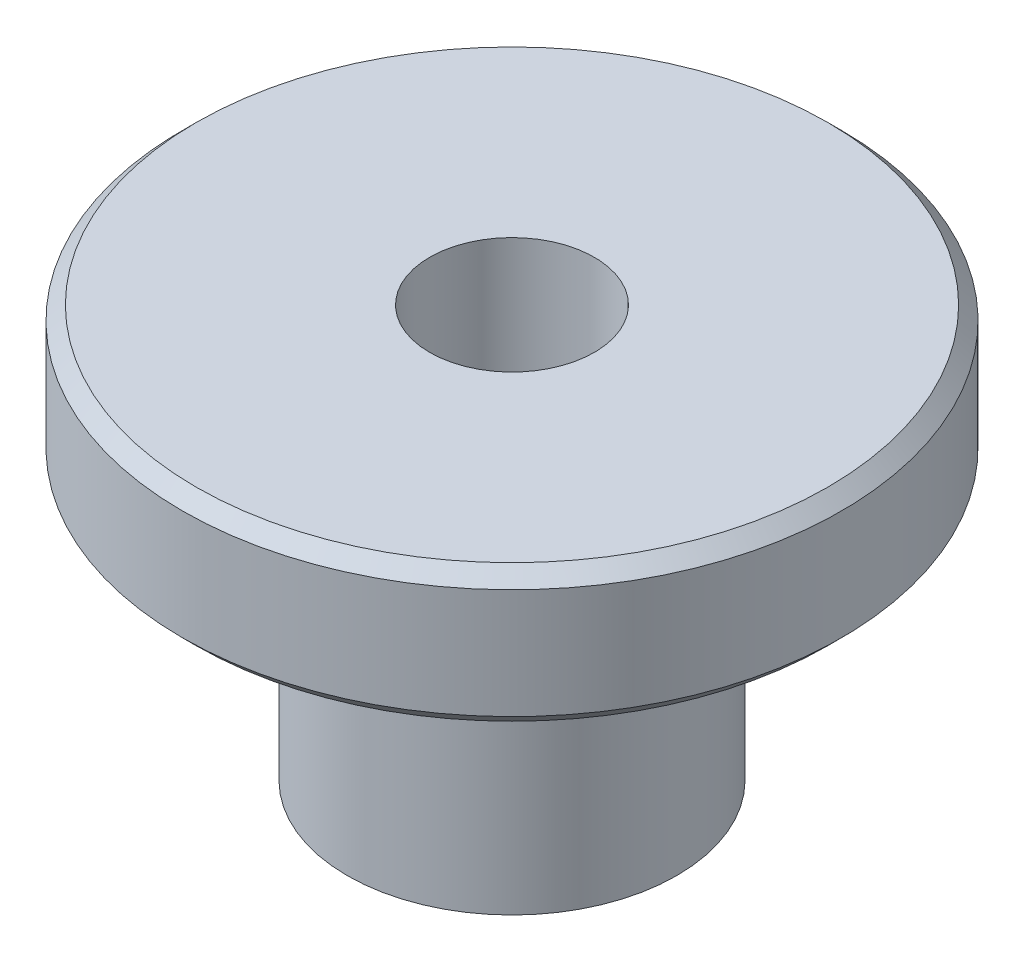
ISO-10303-21;
HEADER;
FILE_DESCRIPTION(('STEP AP214'),'2;1');
FILE_NAME('part.step','',(''),(''),'','','');
FILE_SCHEMA(('AUTOMOTIVE_DESIGN { 1 0 10303 214 1 1 1 1 }'));
ENDSEC;
DATA;
#1=APPLICATION_CONTEXT('core data for automotive mechanical design processes');
#2=APPLICATION_PROTOCOL_DEFINITION('international standard','automotive_design',2000,#1);
#3=PRODUCT_CONTEXT('',#1,'mechanical');
#4=PRODUCT('Part','Part','',(#3));
#5=PRODUCT_RELATED_PRODUCT_CATEGORY('part','',(#4));
#6=PRODUCT_DEFINITION_FORMATION('','',#4);
#7=PRODUCT_DEFINITION_CONTEXT('part definition',#1,'design');
#8=PRODUCT_DEFINITION('design','',#6,#7);
#9=PRODUCT_DEFINITION_SHAPE('','',#8);
#10=(LENGTH_UNIT() NAMED_UNIT(*) SI_UNIT(.MILLI.,.METRE.));
#11=(NAMED_UNIT(*) PLANE_ANGLE_UNIT() SI_UNIT($,.RADIAN.));
#12=(NAMED_UNIT(*) SI_UNIT($,.STERADIAN.) SOLID_ANGLE_UNIT());
#13=UNCERTAINTY_MEASURE_WITH_UNIT(LENGTH_MEASURE(1.E-05),#10,'distance_accuracy_value','');
#14=(GEOMETRIC_REPRESENTATION_CONTEXT(3) GLOBAL_UNCERTAINTY_ASSIGNED_CONTEXT((#13)) GLOBAL_UNIT_ASSIGNED_CONTEXT((#10,
#11,#12)) REPRESENTATION_CONTEXT('',''));
#15=CARTESIAN_POINT('',(0.,0.,0.));
#16=DIRECTION('',(0.,0.,1.));
#17=DIRECTION('',(1.,0.,0.));
#18=AXIS2_PLACEMENT_3D('',#15,#16,#17);
#19=CARTESIAN_POINT('',(5.99999999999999,9.99999999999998,0.));
#20=DIRECTION('',(0.,-1.,0.));
#21=DIRECTION('',(0.,0.,-1.));
#22=AXIS2_PLACEMENT_3D('',#19,#20,#21);
#23=PLANE('',#22);
#24=CARTESIAN_POINT('',(0.,10.,0.));
#25=DIRECTION('',(0.,-1.,0.));
#26=DIRECTION('',(0.,0.,-1.));
#27=AXIS2_PLACEMENT_3D('',#24,#25,#26);
#28=CIRCLE('',#27,6.);
#29=CARTESIAN_POINT('',(0.,10.,-6.));
#30=VERTEX_POINT('',#29);
#31=EDGE_CURVE('E38',#30,#30,#28,.T.);
#32=ORIENTED_EDGE('',*,*,#31,.F.);
#33=EDGE_LOOP('',(#32));
#34=FACE_BOUND('',#33,.T.);
#35=CARTESIAN_POINT('',(0.,10.,0.));
#36=DIRECTION('',(0.,1.,0.));
#37=DIRECTION('',(0.,0.,1.));
#38=AXIS2_PLACEMENT_3D('',#35,#36,#37);
#39=CIRCLE('',#38,11.5);
#40=CARTESIAN_POINT('',(0.,10.,11.5));
#41=VERTEX_POINT('',#40);
#42=EDGE_CURVE('E18',#41,#41,#39,.T.);
#43=ORIENTED_EDGE('',*,*,#42,.F.);
#44=EDGE_LOOP('',(#43));
#45=FACE_BOUND('',#44,.T.);
#46=ADVANCED_FACE('F15',(#34,#45),#23,.T.);
#47=CARTESIAN_POINT('',(0.,10.5,0.));
#48=DIRECTION('',(0.,1.,0.));
#49=DIRECTION('',(0.,0.,1.));
#50=AXIS2_PLACEMENT_3D('',#47,#48,#49);
#51=CONICAL_SURFACE('',#50,12.,0.785398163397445);
#52=CARTESIAN_POINT('',(0.,10.5,0.));
#53=DIRECTION('',(0.,-1.,0.));
#54=DIRECTION('',(0.,0.,-1.));
#55=AXIS2_PLACEMENT_3D('',#52,#53,#54);
#56=CIRCLE('',#55,12.);
#57=CARTESIAN_POINT('',(0.,10.5,-12.));
#58=VERTEX_POINT('',#57);
#59=EDGE_CURVE('E30',#58,#58,#56,.F.);
#60=ORIENTED_EDGE('',*,*,#59,.F.);
#61=EDGE_LOOP('',(#60));
#62=FACE_BOUND('',#61,.T.);
#63=ORIENTED_EDGE('',*,*,#42,.T.);
#64=EDGE_LOOP('',(#63));
#65=FACE_BOUND('',#64,.T.);
#66=ADVANCED_FACE('F46',(#62,#65),#51,.T.);
#67=CARTESIAN_POINT('',(0.,0.,0.));
#68=DIRECTION('',(0.,-1.,0.));
#69=DIRECTION('',(0.,0.,-1.));
#70=AXIS2_PLACEMENT_3D('',#67,#68,#69);
#71=CYLINDRICAL_SURFACE('',#70,6.);
#72=ORIENTED_EDGE('',*,*,#31,.T.);
#73=EDGE_LOOP('',(#72));
#74=FACE_BOUND('',#73,.T.);
#75=CARTESIAN_POINT('',(0.,0.,0.));
#76=DIRECTION('',(0.,-1.,0.));
#77=DIRECTION('',(0.,0.,-1.));
#78=AXIS2_PLACEMENT_3D('',#75,#76,#77);
#79=CIRCLE('',#78,6.);
#80=CARTESIAN_POINT('',(0.,0.,-6.));
#81=VERTEX_POINT('',#80);
#82=EDGE_CURVE('E36',#81,#81,#79,.T.);
#83=ORIENTED_EDGE('',*,*,#82,.F.);
#84=EDGE_LOOP('',(#83));
#85=FACE_BOUND('',#84,.T.);
#86=ADVANCED_FACE('F54',(#74,#85),#71,.T.);
#87=CARTESIAN_POINT('',(0.,0.,0.));
#88=DIRECTION('',(0.,-1.,0.));
#89=DIRECTION('',(0.,0.,-1.));
#90=AXIS2_PLACEMENT_3D('',#87,#88,#89);
#91=CYLINDRICAL_SURFACE('',#90,12.);
#92=ORIENTED_EDGE('',*,*,#59,.T.);
#93=EDGE_LOOP('',(#92));
#94=FACE_BOUND('',#93,.T.);
#95=CARTESIAN_POINT('',(0.,14.4999999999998,0.));
#96=DIRECTION('',(0.,-1.,0.));
#97=DIRECTION('',(0.,0.,-1.));
#98=AXIS2_PLACEMENT_3D('',#95,#96,#97);
#99=CIRCLE('',#98,12.);
#100=CARTESIAN_POINT('',(0.,14.4999999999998,-12.));
#101=VERTEX_POINT('',#100);
#102=EDGE_CURVE('E35',#101,#101,#99,.F.);
#103=ORIENTED_EDGE('',*,*,#102,.F.);
#104=EDGE_LOOP('',(#103));
#105=FACE_BOUND('',#104,.T.);
#106=ADVANCED_FACE('F74',(#94,#105),#91,.T.);
#107=CARTESIAN_POINT('',(0.,0.,0.));
#108=DIRECTION('',(0.,-1.,0.));
#109=DIRECTION('',(0.,0.,-1.));
#110=AXIS2_PLACEMENT_3D('',#107,#108,#109);
#111=PLANE('',#110);
#112=ORIENTED_EDGE('',*,*,#82,.T.);
#113=EDGE_LOOP('',(#112));
#114=FACE_BOUND('',#113,.T.);
#115=CARTESIAN_POINT('',(0.,0.,0.));
#116=DIRECTION('',(0.,1.,0.));
#117=DIRECTION('',(0.,0.,1.));
#118=AXIS2_PLACEMENT_3D('',#115,#116,#117);
#119=CIRCLE('',#118,3.);
#120=CARTESIAN_POINT('',(0.,0.,3.));
#121=VERTEX_POINT('',#120);
#122=EDGE_CURVE('E27',#121,#121,#119,.T.);
#123=ORIENTED_EDGE('',*,*,#122,.T.);
#124=EDGE_LOOP('',(#123));
#125=FACE_BOUND('',#124,.T.);
#126=ADVANCED_FACE('F70',(#114,#125),#111,.T.);
#127=CARTESIAN_POINT('',(0.,14.4999999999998,0.));
#128=DIRECTION('',(0.,-1.,0.));
#129=DIRECTION('',(0.,0.,-1.));
#130=AXIS2_PLACEMENT_3D('',#127,#128,#129);
#131=CONICAL_SURFACE('',#130,12.,0.785398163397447);
#132=ORIENTED_EDGE('',*,*,#102,.T.);
#133=EDGE_LOOP('',(#132));
#134=FACE_BOUND('',#133,.T.);
#135=CARTESIAN_POINT('',(0.,14.9999999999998,0.));
#136=DIRECTION('',(0.,-1.,0.));
#137=DIRECTION('',(0.,0.,-1.));
#138=AXIS2_PLACEMENT_3D('',#135,#136,#137);
#139=CIRCLE('',#138,11.5);
#140=CARTESIAN_POINT('',(0.,14.9999999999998,-11.5));
#141=VERTEX_POINT('',#140);
#142=EDGE_CURVE('E22',#141,#141,#139,.F.);
#143=ORIENTED_EDGE('',*,*,#142,.F.);
#144=EDGE_LOOP('',(#143));
#145=FACE_BOUND('',#144,.T.);
#146=ADVANCED_FACE('F63',(#134,#145),#131,.T.);
#147=CARTESIAN_POINT('',(0.,0.,0.));
#148=DIRECTION('',(0.,1.,0.));
#149=DIRECTION('',(0.,0.,1.));
#150=AXIS2_PLACEMENT_3D('',#147,#148,#149);
#151=CYLINDRICAL_SURFACE('',#150,3.);
#152=CARTESIAN_POINT('',(0.,14.9999999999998,0.));
#153=DIRECTION('',(0.,1.,0.));
#154=DIRECTION('',(0.,0.,1.));
#155=AXIS2_PLACEMENT_3D('',#152,#153,#154);
#156=CIRCLE('',#155,3.);
#157=CARTESIAN_POINT('',(0.,14.9999999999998,3.));
#158=VERTEX_POINT('',#157);
#159=EDGE_CURVE('E10',#158,#158,#156,.F.);
#160=ORIENTED_EDGE('',*,*,#159,.F.);
#161=EDGE_LOOP('',(#160));
#162=FACE_BOUND('',#161,.T.);
#163=ORIENTED_EDGE('',*,*,#122,.F.);
#164=EDGE_LOOP('',(#163));
#165=FACE_BOUND('',#164,.T.);
#166=ADVANCED_FACE('F58',(#162,#165),#151,.F.);
#167=CARTESIAN_POINT('',(12.,15.,0.));
#168=DIRECTION('',(0.,1.,0.));
#169=DIRECTION('',(0.,0.,1.));
#170=AXIS2_PLACEMENT_3D('',#167,#168,#169);
#171=PLANE('',#170);
#172=ORIENTED_EDGE('',*,*,#159,.T.);
#173=EDGE_LOOP('',(#172));
#174=FACE_BOUND('',#173,.T.);
#175=ORIENTED_EDGE('',*,*,#142,.T.);
#176=EDGE_LOOP('',(#175));
#177=FACE_BOUND('',#176,.T.);
#178=ADVANCED_FACE('F56',(#174,#177),#171,.T.);
#179=CLOSED_SHELL('',(#46,#66,#86,#106,#126,#146,#166,#178));
#180=MANIFOLD_SOLID_BREP('B1',#179);
#181=ADVANCED_BREP_SHAPE_REPRESENTATION('',(#18,#180),#14);
#182=SHAPE_DEFINITION_REPRESENTATION(#9,#181);
ENDSEC;
END-ISO-10303-21;
